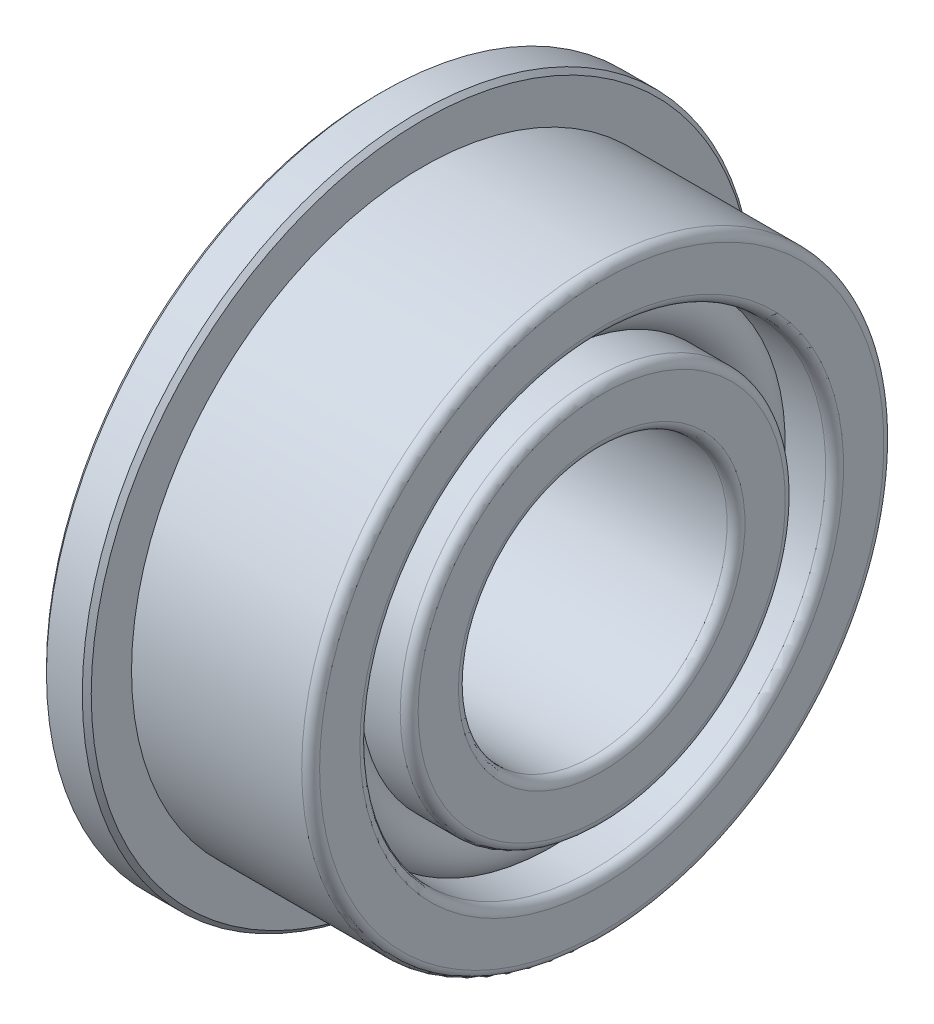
ISO-10303-21;
HEADER;
FILE_DESCRIPTION(('STEP AP214'),'2;1');
FILE_NAME('part.step','',(''),(''),'','','');
FILE_SCHEMA(('AUTOMOTIVE_DESIGN { 1 0 10303 214 1 1 1 1 }'));
ENDSEC;
DATA;
#1=APPLICATION_CONTEXT('core data for automotive mechanical design processes');
#2=APPLICATION_PROTOCOL_DEFINITION('international standard','automotive_design',2000,#1);
#3=PRODUCT_CONTEXT('',#1,'mechanical');
#4=PRODUCT('Part','Part','',(#3));
#5=PRODUCT_RELATED_PRODUCT_CATEGORY('part','',(#4));
#6=PRODUCT_DEFINITION_FORMATION('','',#4);
#7=PRODUCT_DEFINITION_CONTEXT('part definition',#1,'design');
#8=PRODUCT_DEFINITION('design','',#6,#7);
#9=PRODUCT_DEFINITION_SHAPE('','',#8);
#10=(LENGTH_UNIT() NAMED_UNIT(*) SI_UNIT(.MILLI.,.METRE.));
#11=(NAMED_UNIT(*) PLANE_ANGLE_UNIT() SI_UNIT($,.RADIAN.));
#12=(NAMED_UNIT(*) SI_UNIT($,.STERADIAN.) SOLID_ANGLE_UNIT());
#13=UNCERTAINTY_MEASURE_WITH_UNIT(LENGTH_MEASURE(1.E-05),#10,'distance_accuracy_value','');
#14=(GEOMETRIC_REPRESENTATION_CONTEXT(3) GLOBAL_UNCERTAINTY_ASSIGNED_CONTEXT((#13)) GLOBAL_UNIT_ASSIGNED_CONTEXT((#10,
#11,#12)) REPRESENTATION_CONTEXT('',''));
#15=CARTESIAN_POINT('',(0.,0.,0.));
#16=DIRECTION('',(0.,0.,1.));
#17=DIRECTION('',(1.,0.,0.));
#18=AXIS2_PLACEMENT_3D('',#15,#16,#17);
#19=CARTESIAN_POINT('',(2.5,0.,0.));
#20=DIRECTION('',(-1.,0.,0.));
#21=DIRECTION('',(0.,0.,1.));
#22=AXIS2_PLACEMENT_3D('',#19,#20,#21);
#23=TOROIDAL_SURFACE('',#22,4.75,0.600000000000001);
#24=CARTESIAN_POINT('',(2.89686269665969,0.,0.));
#25=DIRECTION('',(-1.,0.,0.));
#26=DIRECTION('',(0.,0.,1.));
#27=AXIS2_PLACEMENT_3D('',#24,#25,#26);
#28=CIRCLE('',#27,5.2);
#29=CARTESIAN_POINT('',(2.89686269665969,0.,5.2));
#30=VERTEX_POINT('',#29);
#31=EDGE_CURVE('E60',#30,#30,#28,.T.);
#32=ORIENTED_EDGE('',*,*,#31,.F.);
#33=EDGE_LOOP('',(#32));
#34=FACE_BOUND('',#33,.T.);
#35=CARTESIAN_POINT('',(2.89686269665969,0.,0.));
#36=DIRECTION('',(-1.,0.,0.));
#37=DIRECTION('',(0.,0.,1.));
#38=AXIS2_PLACEMENT_3D('',#35,#36,#37);
#39=CIRCLE('',#38,4.3);
#40=CARTESIAN_POINT('',(2.89686269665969,0.,4.3));
#41=VERTEX_POINT('',#40);
#42=EDGE_CURVE('E105',#41,#41,#39,.T.);
#43=ORIENTED_EDGE('',*,*,#42,.T.);
#44=EDGE_LOOP('',(#43));
#45=FACE_BOUND('',#44,.T.);
#46=ADVANCED_FACE('F33',(#34,#45),#23,.T.);
#47=CARTESIAN_POINT('',(0.,0.,0.));
#48=DIRECTION('',(-1.,0.,0.));
#49=DIRECTION('',(0.,0.,1.));
#50=AXIS2_PLACEMENT_3D('',#47,#48,#49);
#51=CYLINDRICAL_SURFACE('',#50,5.2);
#52=CARTESIAN_POINT('',(3.8,0.,0.));
#53=DIRECTION('',(-1.,0.,0.));
#54=DIRECTION('',(0.,0.,1.));
#55=AXIS2_PLACEMENT_3D('',#52,#53,#54);
#56=CIRCLE('',#55,5.2);
#57=CARTESIAN_POINT('',(3.8,0.,5.2));
#58=VERTEX_POINT('',#57);
#59=EDGE_CURVE('E63',#58,#58,#56,.T.);
#60=ORIENTED_EDGE('',*,*,#59,.F.);
#61=EDGE_LOOP('',(#60));
#62=FACE_BOUND('',#61,.T.);
#63=ORIENTED_EDGE('',*,*,#31,.T.);
#64=EDGE_LOOP('',(#63));
#65=FACE_BOUND('',#64,.T.);
#66=ADVANCED_FACE('F167',(#62,#65),#51,.F.);
#67=CARTESIAN_POINT('',(3.8,0.,0.));
#68=DIRECTION('',(-1.,0.,0.));
#69=DIRECTION('',(0.,0.,1.));
#70=AXIS2_PLACEMENT_3D('',#67,#68,#69);
#71=TOROIDAL_SURFACE('',#70,5.4,0.200000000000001);
#72=CARTESIAN_POINT('',(4.,0.,0.));
#73=DIRECTION('',(-1.,0.,0.));
#74=DIRECTION('',(0.,0.,1.));
#75=AXIS2_PLACEMENT_3D('',#72,#73,#74);
#76=CIRCLE('',#75,5.4);
#77=CARTESIAN_POINT('',(4.,0.,5.4));
#78=VERTEX_POINT('',#77);
#79=EDGE_CURVE('E66',#78,#78,#76,.T.);
#80=ORIENTED_EDGE('',*,*,#79,.F.);
#81=EDGE_LOOP('',(#80));
#82=FACE_BOUND('',#81,.T.);
#83=ORIENTED_EDGE('',*,*,#59,.T.);
#84=EDGE_LOOP('',(#83));
#85=FACE_BOUND('',#84,.T.);
#86=ADVANCED_FACE('F163',(#82,#85),#71,.T.);
#87=CARTESIAN_POINT('',(4.,6.3,0.));
#88=DIRECTION('',(-1.,0.,0.));
#89=DIRECTION('',(0.,0.,1.));
#90=AXIS2_PLACEMENT_3D('',#87,#88,#89);
#91=PLANE('',#90);
#92=CARTESIAN_POINT('',(4.,0.,0.));
#93=DIRECTION('',(-1.,0.,0.));
#94=DIRECTION('',(0.,0.,1.));
#95=AXIS2_PLACEMENT_3D('',#92,#93,#94);
#96=CIRCLE('',#95,6.3);
#97=CARTESIAN_POINT('',(4.,0.,6.3));
#98=VERTEX_POINT('',#97);
#99=EDGE_CURVE('E69',#98,#98,#96,.T.);
#100=ORIENTED_EDGE('',*,*,#99,.F.);
#101=EDGE_LOOP('',(#100));
#102=FACE_BOUND('',#101,.T.);
#103=ORIENTED_EDGE('',*,*,#79,.T.);
#104=EDGE_LOOP('',(#103));
#105=FACE_BOUND('',#104,.T.);
#106=ADVANCED_FACE('F159',(#102,#105),#91,.F.);
#107=CARTESIAN_POINT('',(3.8,0.,0.));
#108=DIRECTION('',(-1.,0.,0.));
#109=DIRECTION('',(0.,0.,1.));
#110=AXIS2_PLACEMENT_3D('',#107,#108,#109);
#111=TOROIDAL_SURFACE('',#110,6.3,0.200000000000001);
#112=CARTESIAN_POINT('',(3.8,0.,0.));
#113=DIRECTION('',(-1.,0.,0.));
#114=DIRECTION('',(0.,0.,1.));
#115=AXIS2_PLACEMENT_3D('',#112,#113,#114);
#116=CIRCLE('',#115,6.5);
#117=CARTESIAN_POINT('',(3.8,0.,6.5));
#118=VERTEX_POINT('',#117);
#119=EDGE_CURVE('E72',#118,#118,#116,.T.);
#120=ORIENTED_EDGE('',*,*,#119,.F.);
#121=EDGE_LOOP('',(#120));
#122=FACE_BOUND('',#121,.T.);
#123=ORIENTED_EDGE('',*,*,#99,.T.);
#124=EDGE_LOOP('',(#123));
#125=FACE_BOUND('',#124,.T.);
#126=ADVANCED_FACE('F155',(#122,#125),#111,.T.);
#127=CARTESIAN_POINT('',(0.,0.,0.));
#128=DIRECTION('',(-1.,0.,0.));
#129=DIRECTION('',(0.,0.,1.));
#130=AXIS2_PLACEMENT_3D('',#127,#128,#129);
#131=CYLINDRICAL_SURFACE('',#130,6.5);
#132=CARTESIAN_POINT('',(0.,0.,0.));
#133=DIRECTION('',(-1.,0.,0.));
#134=DIRECTION('',(0.,0.,1.));
#135=AXIS2_PLACEMENT_3D('',#132,#133,#134);
#136=CIRCLE('',#135,6.5);
#137=CARTESIAN_POINT('',(0.,0.,6.5));
#138=VERTEX_POINT('',#137);
#139=EDGE_CURVE('E75',#138,#138,#136,.T.);
#140=ORIENTED_EDGE('',*,*,#139,.F.);
#141=EDGE_LOOP('',(#140));
#142=FACE_BOUND('',#141,.T.);
#143=ORIENTED_EDGE('',*,*,#119,.T.);
#144=EDGE_LOOP('',(#143));
#145=FACE_BOUND('',#144,.T.);
#146=ADVANCED_FACE('F151',(#142,#145),#131,.T.);
#147=CARTESIAN_POINT('',(0.,0.,0.));
#148=DIRECTION('',(-1.,0.,0.));
#149=DIRECTION('',(0.,0.,1.));
#150=AXIS2_PLACEMENT_3D('',#147,#148,#149);
#151=CYLINDRICAL_SURFACE('',#150,3.);
#152=CARTESIAN_POINT('',(-0.899999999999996,0.,0.));
#153=DIRECTION('',(-1.,0.,0.));
#154=DIRECTION('',(0.,0.,1.));
#155=AXIS2_PLACEMENT_3D('',#152,#153,#154);
#156=CIRCLE('',#155,3.);
#157=CARTESIAN_POINT('',(-0.899999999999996,0.,3.));
#158=VERTEX_POINT('',#157);
#159=EDGE_CURVE('E10',#158,#158,#156,.T.);
#160=ORIENTED_EDGE('',*,*,#159,.T.);
#161=EDGE_LOOP('',(#160));
#162=FACE_BOUND('',#161,.T.);
#163=CARTESIAN_POINT('',(3.8,0.,0.));
#164=DIRECTION('',(-1.,0.,0.));
#165=DIRECTION('',(0.,0.,1.));
#166=AXIS2_PLACEMENT_3D('',#163,#164,#165);
#167=CIRCLE('',#166,3.);
#168=CARTESIAN_POINT('',(3.8,0.,3.));
#169=VERTEX_POINT('',#168);
#170=EDGE_CURVE('E93',#169,#169,#167,.T.);
#171=ORIENTED_EDGE('',*,*,#170,.F.);
#172=EDGE_LOOP('',(#171));
#173=FACE_BOUND('',#172,.T.);
#174=ADVANCED_FACE('F154',(#162,#173),#151,.F.);
#175=CARTESIAN_POINT('',(3.8,0.,0.));
#176=DIRECTION('',(-1.,0.,0.));
#177=DIRECTION('',(0.,0.,1.));
#178=AXIS2_PLACEMENT_3D('',#175,#176,#177);
#179=TOROIDAL_SURFACE('',#178,3.2,0.200000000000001);
#180=CARTESIAN_POINT('',(4.,0.,0.));
#181=DIRECTION('',(-1.,0.,0.));
#182=DIRECTION('',(0.,0.,1.));
#183=AXIS2_PLACEMENT_3D('',#180,#181,#182);
#184=CIRCLE('',#183,3.2);
#185=CARTESIAN_POINT('',(4.,0.,3.2));
#186=VERTEX_POINT('',#185);
#187=EDGE_CURVE('E96',#186,#186,#184,.T.);
#188=ORIENTED_EDGE('',*,*,#187,.F.);
#189=EDGE_LOOP('',(#188));
#190=FACE_BOUND('',#189,.T.);
#191=ORIENTED_EDGE('',*,*,#170,.T.);
#192=EDGE_LOOP('',(#191));
#193=FACE_BOUND('',#192,.T.);
#194=ADVANCED_FACE('F209',(#190,#193),#179,.T.);
#195=CARTESIAN_POINT('',(4.,3.2,0.));
#196=DIRECTION('',(-1.,0.,0.));
#197=DIRECTION('',(0.,0.,1.));
#198=AXIS2_PLACEMENT_3D('',#195,#196,#197);
#199=PLANE('',#198);
#200=CARTESIAN_POINT('',(4.,0.,0.));
#201=DIRECTION('',(-1.,0.,0.));
#202=DIRECTION('',(0.,0.,1.));
#203=AXIS2_PLACEMENT_3D('',#200,#201,#202);
#204=CIRCLE('',#203,4.1);
#205=CARTESIAN_POINT('',(4.,0.,4.1));
#206=VERTEX_POINT('',#205);
#207=EDGE_CURVE('E99',#206,#206,#204,.T.);
#208=ORIENTED_EDGE('',*,*,#207,.F.);
#209=EDGE_LOOP('',(#208));
#210=FACE_BOUND('',#209,.T.);
#211=ORIENTED_EDGE('',*,*,#187,.T.);
#212=EDGE_LOOP('',(#211));
#213=FACE_BOUND('',#212,.T.);
#214=ADVANCED_FACE('F205',(#210,#213),#199,.F.);
#215=CARTESIAN_POINT('',(3.8,0.,0.));
#216=DIRECTION('',(-1.,0.,0.));
#217=DIRECTION('',(0.,0.,1.));
#218=AXIS2_PLACEMENT_3D('',#215,#216,#217);
#219=TOROIDAL_SURFACE('',#218,4.1,0.2);
#220=CARTESIAN_POINT('',(3.8,0.,0.));
#221=DIRECTION('',(-1.,0.,0.));
#222=DIRECTION('',(0.,0.,1.));
#223=AXIS2_PLACEMENT_3D('',#220,#221,#222);
#224=CIRCLE('',#223,4.3);
#225=CARTESIAN_POINT('',(3.8,0.,4.3));
#226=VERTEX_POINT('',#225);
#227=EDGE_CURVE('E102',#226,#226,#224,.T.);
#228=ORIENTED_EDGE('',*,*,#227,.F.);
#229=EDGE_LOOP('',(#228));
#230=FACE_BOUND('',#229,.T.);
#231=ORIENTED_EDGE('',*,*,#207,.T.);
#232=EDGE_LOOP('',(#231));
#233=FACE_BOUND('',#232,.T.);
#234=ADVANCED_FACE('F199',(#230,#233),#219,.T.);
#235=CARTESIAN_POINT('',(0.,0.,0.));
#236=DIRECTION('',(-1.,0.,0.));
#237=DIRECTION('',(0.,0.,1.));
#238=AXIS2_PLACEMENT_3D('',#235,#236,#237);
#239=CYLINDRICAL_SURFACE('',#238,4.3);
#240=ORIENTED_EDGE('',*,*,#42,.F.);
#241=EDGE_LOOP('',(#240));
#242=FACE_BOUND('',#241,.T.);
#243=ORIENTED_EDGE('',*,*,#227,.T.);
#244=EDGE_LOOP('',(#243));
#245=FACE_BOUND('',#244,.T.);
#246=ADVANCED_FACE('F191',(#242,#245),#239,.T.);
#247=CARTESIAN_POINT('',(-1.,0.,0.));
#248=DIRECTION('',(1.,0.,0.));
#249=DIRECTION('',(0.,0.,-1.));
#250=AXIS2_PLACEMENT_3D('',#247,#248,#249);
#251=CYLINDRICAL_SURFACE('',#250,7.5);
#252=CARTESIAN_POINT('',(-0.0999999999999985,0.,0.));
#253=DIRECTION('',(-1.,0.,0.));
#254=DIRECTION('',(0.,0.,1.));
#255=AXIS2_PLACEMENT_3D('',#252,#253,#254);
#256=CIRCLE('',#255,7.5);
#257=CARTESIAN_POINT('',(-0.0999999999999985,0.,7.5));
#258=VERTEX_POINT('',#257);
#259=EDGE_CURVE('E54',#258,#258,#256,.T.);
#260=ORIENTED_EDGE('',*,*,#259,.T.);
#261=EDGE_LOOP('',(#260));
#262=FACE_BOUND('',#261,.T.);
#263=CARTESIAN_POINT('',(-0.900000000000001,0.,0.));
#264=DIRECTION('',(-1.,0.,0.));
#265=DIRECTION('',(0.,0.,1.));
#266=AXIS2_PLACEMENT_3D('',#263,#264,#265);
#267=CIRCLE('',#266,7.5);
#268=CARTESIAN_POINT('',(-0.900000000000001,0.,7.5));
#269=VERTEX_POINT('',#268);
#270=EDGE_CURVE('E57',#269,#269,#267,.F.);
#271=ORIENTED_EDGE('',*,*,#270,.T.);
#272=EDGE_LOOP('',(#271));
#273=FACE_BOUND('',#272,.T.);
#274=ADVANCED_FACE('F188',(#262,#273),#251,.T.);
#275=CARTESIAN_POINT('',(-1.,0.,0.));
#276=DIRECTION('',(-1.,0.,0.));
#277=DIRECTION('',(0.,0.,1.));
#278=AXIS2_PLACEMENT_3D('',#275,#276,#277);
#279=PLANE('',#278);
#280=CARTESIAN_POINT('',(-1.,0.,0.));
#281=DIRECTION('',(-1.,0.,0.));
#282=DIRECTION('',(0.,0.,1.));
#283=AXIS2_PLACEMENT_3D('',#280,#281,#282);
#284=CIRCLE('',#283,7.4);
#285=CARTESIAN_POINT('',(-1.,0.,7.4));
#286=VERTEX_POINT('',#285);
#287=EDGE_CURVE('E41',#286,#286,#284,.T.);
#288=ORIENTED_EDGE('',*,*,#287,.T.);
#289=EDGE_LOOP('',(#288));
#290=FACE_BOUND('',#289,.T.);
#291=CARTESIAN_POINT('',(-1.,0.,0.));
#292=DIRECTION('',(-1.,0.,0.));
#293=DIRECTION('',(0.,0.,1.));
#294=AXIS2_PLACEMENT_3D('',#291,#292,#293);
#295=CIRCLE('',#294,3.1);
#296=CARTESIAN_POINT('',(-1.,0.,3.1));
#297=VERTEX_POINT('',#296);
#298=EDGE_CURVE('E45',#297,#297,#295,.F.);
#299=ORIENTED_EDGE('',*,*,#298,.T.);
#300=EDGE_LOOP('',(#299));
#301=FACE_BOUND('',#300,.T.);
#302=ADVANCED_FACE('F190',(#290,#301),#279,.T.);
#303=CARTESIAN_POINT('',(0.,0.,0.));
#304=DIRECTION('',(-1.,0.,0.));
#305=DIRECTION('',(0.,0.,1.));
#306=AXIS2_PLACEMENT_3D('',#303,#304,#305);
#307=PLANE('',#306);
#308=CARTESIAN_POINT('',(0.,0.,0.));
#309=DIRECTION('',(-1.,0.,0.));
#310=DIRECTION('',(0.,0.,1.));
#311=AXIS2_PLACEMENT_3D('',#308,#309,#310);
#312=CIRCLE('',#311,7.4);
#313=CARTESIAN_POINT('',(0.,0.,7.4));
#314=VERTEX_POINT('',#313);
#315=EDGE_CURVE('E49',#314,#314,#312,.F.);
#316=ORIENTED_EDGE('',*,*,#315,.T.);
#317=EDGE_LOOP('',(#316));
#318=FACE_BOUND('',#317,.T.);
#319=ORIENTED_EDGE('',*,*,#139,.T.);
#320=EDGE_LOOP('',(#319));
#321=FACE_BOUND('',#320,.T.);
#322=ADVANCED_FACE('F119',(#318,#321),#307,.F.);
#323=CARTESIAN_POINT('',(-0.0999999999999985,0.,0.));
#324=DIRECTION('',(-1.,0.,0.));
#325=DIRECTION('',(0.,0.,1.));
#326=AXIS2_PLACEMENT_3D('',#323,#324,#325);
#327=CONICAL_SURFACE('',#326,7.5,0.785398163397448);
#328=ORIENTED_EDGE('',*,*,#315,.F.);
#329=EDGE_LOOP('',(#328));
#330=FACE_BOUND('',#329,.T.);
#331=ORIENTED_EDGE('',*,*,#259,.F.);
#332=EDGE_LOOP('',(#331));
#333=FACE_BOUND('',#332,.T.);
#334=ADVANCED_FACE('F175',(#330,#333),#327,.T.);
#335=CARTESIAN_POINT('',(-1.,0.,0.));
#336=DIRECTION('',(1.,0.,0.));
#337=DIRECTION('',(0.,0.,-1.));
#338=AXIS2_PLACEMENT_3D('',#335,#336,#337);
#339=CONICAL_SURFACE('',#338,7.4,0.785398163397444);
#340=ORIENTED_EDGE('',*,*,#270,.F.);
#341=EDGE_LOOP('',(#340));
#342=FACE_BOUND('',#341,.T.);
#343=ORIENTED_EDGE('',*,*,#287,.F.);
#344=EDGE_LOOP('',(#343));
#345=FACE_BOUND('',#344,.T.);
#346=ADVANCED_FACE('F177',(#342,#345),#339,.T.);
#347=CARTESIAN_POINT('',(-0.899999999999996,0.,0.));
#348=DIRECTION('',(-1.,0.,0.));
#349=DIRECTION('',(0.,0.,1.));
#350=AXIS2_PLACEMENT_3D('',#347,#348,#349);
#351=CONICAL_SURFACE('',#350,3.,0.78539816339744);
#352=ORIENTED_EDGE('',*,*,#298,.F.);
#353=EDGE_LOOP('',(#352));
#354=FACE_BOUND('',#353,.T.);
#355=ORIENTED_EDGE('',*,*,#159,.F.);
#356=EDGE_LOOP('',(#355));
#357=FACE_BOUND('',#356,.T.);
#358=ADVANCED_FACE('F35',(#354,#357),#351,.F.);
#359=CLOSED_SHELL('',(#46,#66,#86,#106,#126,#146,#174,#194,#214,#234,#246,#274,#302,#322,#334,
#346,#358));
#360=CARTESIAN_POINT('',(0.,0.,0.));
#361=DIRECTION('',(-1.,0.,0.));
#362=DIRECTION('',(0.,0.,1.));
#363=AXIS2_PLACEMENT_3D('',#360,#361,#362);
#364=CIRCLE('',#363,5.39161575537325);
#365=CARTESIAN_POINT('',(0.,0.,5.39161575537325));
#366=VERTEX_POINT('',#365);
#367=EDGE_CURVE('E108',#366,#366,#364,.T.);
#368=ORIENTED_EDGE('',*,*,#367,.F.);
#369=EDGE_LOOP('',(#368));
#370=FACE_BOUND('',#369,.T.);
#371=CARTESIAN_POINT('',(0.,0.,0.));
#372=DIRECTION('',(-1.,0.,0.));
#373=DIRECTION('',(0.,0.,1.));
#374=AXIS2_PLACEMENT_3D('',#371,#372,#373);
#375=CIRCLE('',#374,4.10838424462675);
#376=CARTESIAN_POINT('',(0.,0.,4.10838424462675));
#377=VERTEX_POINT('',#376);
#378=EDGE_CURVE('E90',#377,#377,#375,.T.);
#379=ORIENTED_EDGE('',*,*,#378,.T.);
#380=EDGE_LOOP('',(#379));
#381=FACE_BOUND('',#380,.T.);
#382=ADVANCED_FACE('F114',(#370,#381),#307,.F.);
#383=CARTESIAN_POINT('',(0.,0.,0.));
#384=DIRECTION('',(-1.,0.,0.));
#385=DIRECTION('',(0.,0.,1.));
#386=AXIS2_PLACEMENT_3D('',#383,#384,#385);
#387=CYLINDRICAL_SURFACE('',#386,5.2);
#388=CARTESIAN_POINT('',(2.10313730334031,0.,0.));
#389=DIRECTION('',(-1.,0.,0.));
#390=DIRECTION('',(0.,0.,1.));
#391=AXIS2_PLACEMENT_3D('',#388,#389,#390);
#392=CIRCLE('',#391,5.2);
#393=CARTESIAN_POINT('',(2.10313730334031,0.,5.2));
#394=VERTEX_POINT('',#393);
#395=EDGE_CURVE('E81',#394,#394,#392,.T.);
#396=ORIENTED_EDGE('',*,*,#395,.F.);
#397=EDGE_LOOP('',(#396));
#398=FACE_BOUND('',#397,.T.);
#399=CARTESIAN_POINT('',(0.191615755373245,0.,0.));
#400=DIRECTION('',(-1.,0.,0.));
#401=DIRECTION('',(0.,0.,1.));
#402=AXIS2_PLACEMENT_3D('',#399,#400,#401);
#403=CIRCLE('',#402,5.2);
#404=CARTESIAN_POINT('',(0.191615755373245,0.,5.2));
#405=VERTEX_POINT('',#404);
#406=EDGE_CURVE('E78',#405,#405,#403,.T.);
#407=ORIENTED_EDGE('',*,*,#406,.T.);
#408=EDGE_LOOP('',(#407));
#409=FACE_BOUND('',#408,.T.);
#410=ADVANCED_FACE('F117',(#398,#409),#387,.F.);
#411=CARTESIAN_POINT('',(0.191615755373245,0.,0.));
#412=DIRECTION('',(-1.,0.,0.));
#413=DIRECTION('',(0.,0.,1.));
#414=AXIS2_PLACEMENT_3D('',#411,#412,#413);
#415=TOROIDAL_SURFACE('',#414,5.39161575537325,0.191615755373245);
#416=ORIENTED_EDGE('',*,*,#406,.F.);
#417=EDGE_LOOP('',(#416));
#418=FACE_BOUND('',#417,.T.);
#419=ORIENTED_EDGE('',*,*,#367,.T.);
#420=EDGE_LOOP('',(#419));
#421=FACE_BOUND('',#420,.T.);
#422=ADVANCED_FACE('F112',(#418,#421),#415,.T.);
#423=CARTESIAN_POINT('',(2.5,0.,0.));
#424=DIRECTION('',(-1.,0.,0.));
#425=DIRECTION('',(0.,0.,1.));
#426=AXIS2_PLACEMENT_3D('',#423,#424,#425);
#427=TOROIDAL_SURFACE('',#426,4.75,0.600000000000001);
#428=CARTESIAN_POINT('',(2.10313730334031,0.,0.));
#429=DIRECTION('',(-1.,0.,0.));
#430=DIRECTION('',(0.,0.,1.));
#431=AXIS2_PLACEMENT_3D('',#428,#429,#430);
#432=CIRCLE('',#431,4.3);
#433=CARTESIAN_POINT('',(2.10313730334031,0.,4.3));
#434=VERTEX_POINT('',#433);
#435=EDGE_CURVE('E84',#434,#434,#432,.T.);
#436=ORIENTED_EDGE('',*,*,#435,.F.);
#437=EDGE_LOOP('',(#436));
#438=FACE_BOUND('',#437,.T.);
#439=ORIENTED_EDGE('',*,*,#395,.T.);
#440=EDGE_LOOP('',(#439));
#441=FACE_BOUND('',#440,.T.);
#442=ADVANCED_FACE('F132',(#438,#441),#427,.T.);
#443=CARTESIAN_POINT('',(0.,0.,0.));
#444=DIRECTION('',(-1.,0.,0.));
#445=DIRECTION('',(0.,0.,1.));
#446=AXIS2_PLACEMENT_3D('',#443,#444,#445);
#447=CYLINDRICAL_SURFACE('',#446,4.3);
#448=CARTESIAN_POINT('',(0.191615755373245,0.,0.));
#449=DIRECTION('',(-1.,0.,0.));
#450=DIRECTION('',(0.,0.,1.));
#451=AXIS2_PLACEMENT_3D('',#448,#449,#450);
#452=CIRCLE('',#451,4.3);
#453=CARTESIAN_POINT('',(0.191615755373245,0.,4.3));
#454=VERTEX_POINT('',#453);
#455=EDGE_CURVE('E87',#454,#454,#452,.T.);
#456=ORIENTED_EDGE('',*,*,#455,.F.);
#457=EDGE_LOOP('',(#456));
#458=FACE_BOUND('',#457,.T.);
#459=ORIENTED_EDGE('',*,*,#435,.T.);
#460=EDGE_LOOP('',(#459));
#461=FACE_BOUND('',#460,.T.);
#462=ADVANCED_FACE('F126',(#458,#461),#447,.T.);
#463=CARTESIAN_POINT('',(0.191615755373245,0.,0.));
#464=DIRECTION('',(-1.,0.,0.));
#465=DIRECTION('',(0.,0.,1.));
#466=AXIS2_PLACEMENT_3D('',#463,#464,#465);
#467=TOROIDAL_SURFACE('',#466,4.10838424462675,0.191615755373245);
#468=ORIENTED_EDGE('',*,*,#378,.F.);
#469=EDGE_LOOP('',(#468));
#470=FACE_BOUND('',#469,.T.);
#471=ORIENTED_EDGE('',*,*,#455,.T.);
#472=EDGE_LOOP('',(#471));
#473=FACE_BOUND('',#472,.T.);
#474=ADVANCED_FACE('F123',(#470,#473),#467,.T.);
#475=CLOSED_SHELL('',(#382,#410,#422,#442,#462,#474));
#476=ORIENTED_CLOSED_SHELL('',*,#475,.T.);
#477=BREP_WITH_VOIDS('B2',#359,(#476));
#478=ADVANCED_BREP_SHAPE_REPRESENTATION('',(#18,#477),#14);
#479=SHAPE_DEFINITION_REPRESENTATION(#9,#478);
ENDSEC;
END-ISO-10303-21;
